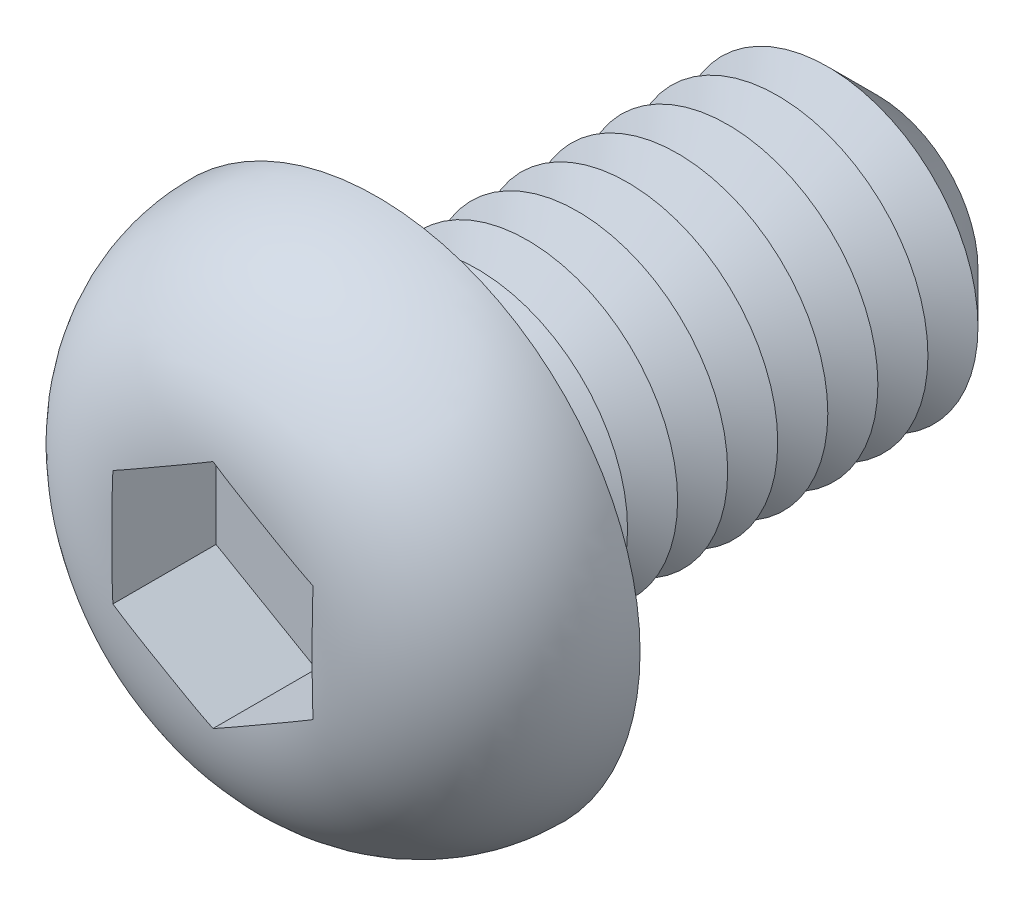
ISO-10303-21;
HEADER;
FILE_DESCRIPTION(('STEP AP214'),'2;1');
FILE_NAME('part.step','',(''),(''),'','','');
FILE_SCHEMA(('AUTOMOTIVE_DESIGN { 1 0 10303 214 1 1 1 1 }'));
ENDSEC;
DATA;
#1=APPLICATION_CONTEXT('core data for automotive mechanical design processes');
#2=APPLICATION_PROTOCOL_DEFINITION('international standard','automotive_design',2000,#1);
#3=PRODUCT_CONTEXT('',#1,'mechanical');
#4=PRODUCT('Part','Part','',(#3));
#5=PRODUCT_RELATED_PRODUCT_CATEGORY('part','',(#4));
#6=PRODUCT_DEFINITION_FORMATION('','',#4);
#7=PRODUCT_DEFINITION_CONTEXT('part definition',#1,'design');
#8=PRODUCT_DEFINITION('design','',#6,#7);
#9=PRODUCT_DEFINITION_SHAPE('','',#8);
#10=(LENGTH_UNIT() NAMED_UNIT(*) SI_UNIT(.MILLI.,.METRE.));
#11=(NAMED_UNIT(*) PLANE_ANGLE_UNIT() SI_UNIT($,.RADIAN.));
#12=(NAMED_UNIT(*) SI_UNIT($,.STERADIAN.) SOLID_ANGLE_UNIT());
#13=UNCERTAINTY_MEASURE_WITH_UNIT(LENGTH_MEASURE(1.E-05),#10,'distance_accuracy_value','');
#14=(GEOMETRIC_REPRESENTATION_CONTEXT(3) GLOBAL_UNCERTAINTY_ASSIGNED_CONTEXT((#13)) GLOBAL_UNIT_ASSIGNED_CONTEXT((#10,
#11,#12)) REPRESENTATION_CONTEXT('',''));
#15=CARTESIAN_POINT('',(0.,0.,0.));
#16=DIRECTION('',(0.,0.,1.));
#17=DIRECTION('',(1.,0.,0.));
#18=AXIS2_PLACEMENT_3D('',#15,#16,#17);
#19=CARTESIAN_POINT('',(0.,0.,-10.));
#20=DIRECTION('',(0.,0.,1.));
#21=DIRECTION('',(1.,0.,0.));
#22=AXIS2_PLACEMENT_3D('',#19,#20,#21);
#23=CYLINDRICAL_SURFACE('',#22,3.);
#24=CARTESIAN_POINT('',(0.,0.,-0.5));
#25=DIRECTION('',(0.,0.,1.));
#26=DIRECTION('',(1.,0.,0.));
#27=AXIS2_PLACEMENT_3D('',#24,#25,#26);
#28=CIRCLE('',#27,3.);
#29=CARTESIAN_POINT('',(3.,0.,-0.5));
#30=VERTEX_POINT('',#29);
#31=EDGE_CURVE('E48',#30,#30,#28,.F.);
#32=ORIENTED_EDGE('',*,*,#31,.T.);
#33=EDGE_LOOP('',(#32));
#34=FACE_BOUND('',#33,.T.);
#35=CARTESIAN_POINT('',(0.,0.,-1.));
#36=DIRECTION('',(0.,0.,1.));
#37=DIRECTION('',(1.,0.,0.));
#38=AXIS2_PLACEMENT_3D('',#35,#36,#37);
#39=CIRCLE('',#38,3.);
#40=CARTESIAN_POINT('',(3.,0.,-1.));
#41=VERTEX_POINT('',#40);
#42=EDGE_CURVE('E118',#41,#41,#39,.T.);
#43=ORIENTED_EDGE('',*,*,#42,.T.);
#44=EDGE_LOOP('',(#43));
#45=FACE_BOUND('',#44,.T.);
#46=ADVANCED_FACE('F39',(#34,#45),#23,.T.);
#47=CARTESIAN_POINT('',(0.,5.25,0.));
#48=DIRECTION('',(0.,0.,1.));
#49=DIRECTION('',(1.,0.,0.));
#50=AXIS2_PLACEMENT_3D('',#47,#48,#49);
#51=PLANE('',#50);
#52=CARTESIAN_POINT('',(0.,0.,0.));
#53=DIRECTION('',(0.,0.,1.));
#54=DIRECTION('',(1.,0.,0.));
#55=AXIS2_PLACEMENT_3D('',#52,#53,#54);
#56=CIRCLE('',#55,3.5);
#57=CARTESIAN_POINT('',(3.5,0.,0.));
#58=VERTEX_POINT('',#57);
#59=EDGE_CURVE('E11',#58,#58,#56,.T.);
#60=ORIENTED_EDGE('',*,*,#59,.T.);
#61=EDGE_LOOP('',(#60));
#62=FACE_BOUND('',#61,.T.);
#63=CARTESIAN_POINT('',(0.,0.,0.));
#64=DIRECTION('',(0.,0.,1.));
#65=DIRECTION('',(1.,0.,0.));
#66=AXIS2_PLACEMENT_3D('',#63,#64,#65);
#67=CIRCLE('',#66,5.25);
#68=CARTESIAN_POINT('',(5.25,0.,0.));
#69=VERTEX_POINT('',#68);
#70=EDGE_CURVE('E141',#69,#69,#67,.T.);
#71=ORIENTED_EDGE('',*,*,#70,.F.);
#72=EDGE_LOOP('',(#71));
#73=FACE_BOUND('',#72,.T.);
#74=ADVANCED_FACE('F216',(#62,#73),#51,.F.);
#75=CARTESIAN_POINT('',(0.,0.,0.));
#76=DIRECTION('',(0.,0.,1.));
#77=DIRECTION('',(1.,0.,0.));
#78=AXIS2_PLACEMENT_3D('',#75,#76,#77);
#79=DEGENERATE_TOROIDAL_SURFACE('',#78,1.95,3.3,.T.);
#80=CARTESIAN_POINT('',(-2.0002,1.15458506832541,3.28035788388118));
#81=CARTESIAN_POINT('',(-1.91691288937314,1.20267090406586,3.28561413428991));
#82=CARTESIAN_POINT('',(-1.83357497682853,1.25078607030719,3.2893341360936));
#83=CARTESIAN_POINT('',(-1.66686712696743,1.34703489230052,3.29467873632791));
#84=CARTESIAN_POINT('',(-1.58349720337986,1.39516854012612,3.29630387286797));
#85=CARTESIAN_POINT('',(-1.4167768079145,1.49142460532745,3.29843721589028));
#86=CARTESIAN_POINT('',(-1.33342633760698,1.53954702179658,3.29894575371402));
#87=CARTESIAN_POINT('',(-1.16671724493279,1.63579656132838,3.29953775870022));
#88=CARTESIAN_POINT('',(-1.0833586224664,1.68392368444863,3.29962119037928));
#89=CARTESIAN_POINT('',(-0.916641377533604,1.78017793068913,3.29962119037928));
#90=CARTESIAN_POINT('',(-0.833282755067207,1.82830505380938,3.29953775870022));
#91=CARTESIAN_POINT('',(-0.666573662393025,1.92455459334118,3.29894575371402));
#92=CARTESIAN_POINT('',(-0.5832231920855,1.97267700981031,3.29843721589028));
#93=CARTESIAN_POINT('',(-0.416502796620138,2.06893307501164,3.29630387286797));
#94=CARTESIAN_POINT('',(-0.333132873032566,2.11706672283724,3.29467873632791));
#95=CARTESIAN_POINT('',(-0.166425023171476,2.21331554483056,3.2893341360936));
#96=CARTESIAN_POINT('',(-0.083087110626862,2.2614307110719,3.28561413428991));
#97=CARTESIAN_POINT('',(0.000200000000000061,2.30951654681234,3.28035788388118));
#98=B_SPLINE_CURVE_WITH_KNOTS('',3,(#80,#81,#82,#83,#84,#85,#86,#87,#88,#89,#90,#91,#92,#93,#94,
#95,#96,#97),.UNSPECIFIED.,.F.,.F.,(4,2,2,2,2,2,2,2,4),(0.,0.288898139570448,0.577722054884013,
0.866460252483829,1.15522255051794,1.44398484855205,1.73272304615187,2.02154696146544,
2.31044510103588),.UNSPECIFIED.);
#99=CARTESIAN_POINT('',(-2.,1.15470053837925,3.28037053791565));
#100=VERTEX_POINT('',#99);
#101=CARTESIAN_POINT('',(0.,2.3094010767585,3.28037053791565));
#102=VERTEX_POINT('',#101);
#103=EDGE_CURVE('E157',#100,#102,#98,.T.);
#104=ORIENTED_EDGE('',*,*,#103,.T.);
#105=CARTESIAN_POINT('',(-0.000199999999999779,2.30951654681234,3.28035788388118));
#106=CARTESIAN_POINT('',(0.0830871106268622,2.2614307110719,3.28561413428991));
#107=CARTESIAN_POINT('',(0.166425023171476,2.21331554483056,3.2893341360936));
#108=CARTESIAN_POINT('',(0.333132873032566,2.11706672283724,3.29467873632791));
#109=CARTESIAN_POINT('',(0.416502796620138,2.06893307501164,3.29630387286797));
#110=CARTESIAN_POINT('',(0.5832231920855,1.97267700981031,3.29843721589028));
#111=CARTESIAN_POINT('',(0.666573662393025,1.92455459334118,3.29894575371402));
#112=CARTESIAN_POINT('',(0.833282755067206,1.82830505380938,3.29953775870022));
#113=CARTESIAN_POINT('',(0.916641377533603,1.78017793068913,3.29962119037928));
#114=CARTESIAN_POINT('',(1.0833586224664,1.68392368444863,3.29962119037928));
#115=CARTESIAN_POINT('',(1.16671724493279,1.63579656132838,3.29953775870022));
#116=CARTESIAN_POINT('',(1.33342633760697,1.53954702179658,3.29894575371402));
#117=CARTESIAN_POINT('',(1.4167768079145,1.49142460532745,3.29843721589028));
#118=CARTESIAN_POINT('',(1.58349720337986,1.39516854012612,3.29630387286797));
#119=CARTESIAN_POINT('',(1.66686712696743,1.34703489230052,3.29467873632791));
#120=CARTESIAN_POINT('',(1.83357497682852,1.25078607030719,3.2893341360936));
#121=CARTESIAN_POINT('',(1.91691288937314,1.20267090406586,3.28561413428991));
#122=CARTESIAN_POINT('',(2.0002,1.15458506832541,3.28035788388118));
#123=B_SPLINE_CURVE_WITH_KNOTS('',3,(#105,#106,#107,#108,#109,#110,#111,#112,#113,#114,#115,
#116,#117,#118,#119,#120,#121,#122),.UNSPECIFIED.,.F.,.F.,(4,2,2,2,2,2,2,2,4),(0.,
0.288898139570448,0.577722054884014,0.866460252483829,1.15522255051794,1.44398484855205,
1.73272304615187,2.02154696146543,2.31044510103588),.UNSPECIFIED.);
#124=CARTESIAN_POINT('',(2.,1.15470053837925,3.28037053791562));
#125=VERTEX_POINT('',#124);
#126=EDGE_CURVE('E98',#102,#125,#123,.T.);
#127=ORIENTED_EDGE('',*,*,#126,.T.);
#128=CARTESIAN_POINT('',(2.,0.,3.29962119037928));
#129=CARTESIAN_POINT('',(2.,-0.083776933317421,3.29962202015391));
#130=CARTESIAN_POINT('',(2.,-0.16755385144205,3.29955399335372));
#131=CARTESIAN_POINT('',(2.,-0.335108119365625,3.29913665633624));
#132=CARTESIAN_POINT('',(2.,-0.418885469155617,3.29878734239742));
#133=CARTESIAN_POINT('',(2.,-0.58647412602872,3.29739645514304));
#134=CARTESIAN_POINT('',(2.,-0.670285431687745,3.29635457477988));
#135=CARTESIAN_POINT('',(2.,-0.83788107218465,3.29299045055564));
#136=CARTESIAN_POINT('',(2.,-0.921665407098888,3.29066821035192));
#137=CARTESIAN_POINT('',(2.,-1.1722454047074,3.2807858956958));
#138=CARTESIAN_POINT('',(2.,-1.33895832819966,3.27031526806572));
#139=CARTESIAN_POINT('',(2.,-1.67103623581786,3.23635494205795));
#140=CARTESIAN_POINT('',(2.,-1.83640244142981,3.21287879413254));
#141=CARTESIAN_POINT('',(2.,-2.10344176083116,3.16074182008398));
#142=CARTESIAN_POINT('',(2.,-2.2061099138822,3.13718731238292));
#143=CARTESIAN_POINT('',(2.,-2.40948794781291,3.08263206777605));
#144=CARTESIAN_POINT('',(2.,-2.51019754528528,3.05163026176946));
#145=CARTESIAN_POINT('',(2.,-2.70894468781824,2.98167613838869));
#146=CARTESIAN_POINT('',(2.,-2.80697949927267,2.94271600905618));
#147=CARTESIAN_POINT('',(2.,-2.9994014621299,2.85662314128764));
#148=CARTESIAN_POINT('',(2.,-3.09378880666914,2.80949083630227));
#149=CARTESIAN_POINT('',(2.,-3.27874879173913,2.70660110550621));
#150=CARTESIAN_POINT('',(2.,-3.36928473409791,2.6507774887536));
#151=CARTESIAN_POINT('',(2.,-3.54476824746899,2.53095107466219));
#152=CARTESIAN_POINT('',(2.,-3.6297163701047,2.46694908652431));
#153=CARTESIAN_POINT('',(2.,-3.79309021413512,2.33110056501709));
#154=CARTESIAN_POINT('',(2.,-3.87151694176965,2.25925524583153));
#155=CARTESIAN_POINT('',(2.,-4.02093628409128,2.10826339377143));
#156=CARTESIAN_POINT('',(2.,-4.09192987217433,2.02911781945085));
#157=CARTESIAN_POINT('',(2.,-4.27732278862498,1.8003635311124));
#158=CARTESIAN_POINT('',(2.,-4.38297261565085,1.64348590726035));
#159=CARTESIAN_POINT('',(2.,-4.564185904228,1.31336862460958));
#160=CARTESIAN_POINT('',(2.,-4.63976443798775,1.14013721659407));
#161=CARTESIAN_POINT('',(2.,-4.75417820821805,0.794488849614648));
#162=CARTESIAN_POINT('',(2.,-4.79509243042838,0.622758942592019));
#163=CARTESIAN_POINT('',(2.,-4.84679751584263,0.274828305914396));
#164=CARTESIAN_POINT('',(2.,-4.85759267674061,0.098628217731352));
#165=CARTESIAN_POINT('',(2.,-4.8487955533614,-0.249157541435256));
#166=CARTESIAN_POINT('',(2.,-4.82985906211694,-0.420760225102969));
#167=CARTESIAN_POINT('',(2.,-4.76345103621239,-0.758322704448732));
#168=CARTESIAN_POINT('',(2.,-4.71598351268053,-0.924283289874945));
#169=CARTESIAN_POINT('',(2.,-4.59404942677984,-1.24604183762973));
#170=CARTESIAN_POINT('',(2.,-4.51956988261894,-1.40183487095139));
#171=CARTESIAN_POINT('',(2.,-4.34600859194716,-1.6990817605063));
#172=CARTESIAN_POINT('',(2.,-4.24691988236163,-1.84053154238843));
#173=CARTESIAN_POINT('',(2.,-4.02493220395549,-2.10847549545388));
#174=CARTESIAN_POINT('',(2.,-3.90156532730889,-2.23458080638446));
#175=CARTESIAN_POINT('',(2.,-3.63636218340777,-2.46550695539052));
#176=CARTESIAN_POINT('',(2.,-3.49453117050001,-2.57033382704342));
#177=CARTESIAN_POINT('',(2.,-3.26713798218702,-2.7130834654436));
#178=CARTESIAN_POINT('',(2.,-3.18660091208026,-2.75923686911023));
#179=CARTESIAN_POINT('',(2.,-3.02216370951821,-2.84520816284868));
#180=CARTESIAN_POINT('',(2.,-2.93826250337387,-2.88502400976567));
#181=CARTESIAN_POINT('',(2.,-2.76779132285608,-2.95832456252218));
#182=CARTESIAN_POINT('',(2.,-2.68122238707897,-2.99181169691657));
#183=CARTESIAN_POINT('',(2.,-2.50604626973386,-3.05263810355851));
#184=CARTESIAN_POINT('',(2.,-2.41744088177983,-3.07998257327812));
#185=CARTESIAN_POINT('',(2.,-2.20396420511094,-3.13835394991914));
#186=CARTESIAN_POINT('',(2.,-2.07835656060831,-3.16669536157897));
#187=CARTESIAN_POINT('',(2.,-1.82529007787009,-3.2134938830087));
#188=CARTESIAN_POINT('',(2.,-1.69783012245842,-3.23194474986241));
#189=CARTESIAN_POINT('',(2.,-1.44149598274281,-3.26083645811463));
#190=CARTESIAN_POINT('',(2.,-1.31261808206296,-3.27124272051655));
#191=CARTESIAN_POINT('',(2.,-1.05456848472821,-3.28623769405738));
#192=CARTESIAN_POINT('',(2.,-0.925396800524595,-3.29082664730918));
#193=CARTESIAN_POINT('',(2.,-0.665550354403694,-3.29674923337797));
#194=CARTESIAN_POINT('',(2.,-0.53487497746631,-3.29804579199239));
#195=CARTESIAN_POINT('',(2.,-0.273526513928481,-3.29947536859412));
#196=CARTESIAN_POINT('',(2.,-0.142853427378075,-3.29960842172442));
#197=CARTESIAN_POINT('',(2.,0.118243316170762,-3.29963281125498));
#198=CARTESIAN_POINT('',(2.,0.248666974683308,-3.29952460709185));
#199=CARTESIAN_POINT('',(2.,0.509509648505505,-3.29825409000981));
#200=CARTESIAN_POINT('',(2.,0.639928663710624,-3.29709183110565));
#201=CARTESIAN_POINT('',(2.,0.831730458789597,-3.29304171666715));
#202=CARTESIAN_POINT('',(2.,0.89313616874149,-3.29139197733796));
#203=CARTESIAN_POINT('',(2.,1.01591282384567,-3.28711504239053));
#204=CARTESIAN_POINT('',(2.,1.07728376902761,-3.28448784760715));
#205=CARTESIAN_POINT('',(2.,1.26131335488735,-3.27473407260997));
#206=CARTESIAN_POINT('',(2.,1.38388698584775,-3.2657353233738));
#207=CARTESIAN_POINT('',(2.,1.62750125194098,-3.24079239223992));
#208=CARTESIAN_POINT('',(2.,1.74854662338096,-3.22489680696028));
#209=CARTESIAN_POINT('',(2.,1.98924449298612,-3.18452451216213));
#210=CARTESIAN_POINT('',(2.,2.10889688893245,-3.16004717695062));
#211=CARTESIAN_POINT('',(2.,2.34827145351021,-3.10067973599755));
#212=CARTESIAN_POINT('',(2.,2.46794336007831,-3.06558373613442));
#213=CARTESIAN_POINT('',(2.,2.70350765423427,-2.98433995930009));
#214=CARTESIAN_POINT('',(2.,2.8194000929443,-2.9381923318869));
#215=CARTESIAN_POINT('',(2.,3.0462872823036,-2.83430045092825));
#216=CARTESIAN_POINT('',(2.,3.157267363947,-2.77652399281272));
#217=CARTESIAN_POINT('',(2.,3.37244069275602,-2.64945989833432));
#218=CARTESIAN_POINT('',(2.,3.47663511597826,-2.58017426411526));
#219=CARTESIAN_POINT('',(2.,3.66184410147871,-2.44158969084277));
#220=CARTESIAN_POINT('',(2.,3.74400419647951,-2.37381785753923));
#221=CARTESIAN_POINT('',(2.,3.90136233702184,-2.23063102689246));
#222=CARTESIAN_POINT('',(2.,3.9765614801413,-2.1552172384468));
#223=CARTESIAN_POINT('',(2.,4.11902811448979,-1.99742327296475));
#224=CARTESIAN_POINT('',(2.,4.18630715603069,-1.91505354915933));
#225=CARTESIAN_POINT('',(2.,4.31224227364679,-1.74401295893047));
#226=CARTESIAN_POINT('',(2.,4.37089943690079,-1.65534288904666));
#227=CARTESIAN_POINT('',(2.,4.51742320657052,-1.40720395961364));
#228=CARTESIAN_POINT('',(2.,4.59632371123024,-1.24230503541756));
#229=CARTESIAN_POINT('',(2.,4.72377654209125,-0.901269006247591));
#230=CARTESIAN_POINT('',(2.,4.77233626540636,-0.725134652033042));
#231=CARTESIAN_POINT('',(2.,4.83594291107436,-0.375162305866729));
#232=CARTESIAN_POINT('',(2.,4.85240855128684,-0.201581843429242));
#233=CARTESIAN_POINT('',(2.,4.85558073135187,0.145835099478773));
#234=CARTESIAN_POINT('',(2.,4.8422910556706,0.319671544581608));
#235=CARTESIAN_POINT('',(2.,4.78674180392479,0.660539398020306));
#236=CARTESIAN_POINT('',(2.,4.74482430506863,0.827626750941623));
#237=CARTESIAN_POINT('',(2.,4.63375789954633,1.15246461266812));
#238=CARTESIAN_POINT('',(2.,4.56461058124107,1.31021566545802));
#239=CARTESIAN_POINT('',(2.,4.40063624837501,1.61344814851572));
#240=CARTESIAN_POINT('',(2.,4.30559842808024,1.75881539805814));
#241=CARTESIAN_POINT('',(2.,4.09315528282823,2.03216183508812));
#242=CARTESIAN_POINT('',(2.,3.97574503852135,2.16013718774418));
#243=CARTESIAN_POINT('',(2.,3.71810418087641,2.3997527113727));
#244=CARTESIAN_POINT('',(2.,3.57725563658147,2.51072635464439));
#245=CARTESIAN_POINT('',(2.,3.28005668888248,2.70933274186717));
#246=CARTESIAN_POINT('',(2.,3.12370896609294,2.79696951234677));
#247=CARTESIAN_POINT('',(2.,2.85462284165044,2.92305372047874));
#248=CARTESIAN_POINT('',(2.,2.74490899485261,2.96813077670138));
#249=CARTESIAN_POINT('',(2.,2.52184151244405,3.04824715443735));
#250=CARTESIAN_POINT('',(2.,2.40848685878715,3.08328364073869));
#251=CARTESIAN_POINT('',(2.,2.17918323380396,3.14397693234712));
#252=CARTESIAN_POINT('',(2.,2.06323128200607,3.16962230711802));
#253=CARTESIAN_POINT('',(2.,1.82982653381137,3.21251895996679));
#254=CARTESIAN_POINT('',(2.,1.71237385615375,3.229770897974));
#255=CARTESIAN_POINT('',(2.,1.46252543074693,3.2589582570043));
#256=CARTESIAN_POINT('',(2.,1.3300298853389,3.27000580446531));
#257=CARTESIAN_POINT('',(2.,1.0646774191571,3.28585371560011));
#258=CARTESIAN_POINT('',(2.,0.931820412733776,3.29065244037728));
#259=CARTESIAN_POINT('',(2.,0.665789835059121,3.29677132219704));
#260=CARTESIAN_POINT('',(2.,0.532616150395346,3.29808470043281));
#261=CARTESIAN_POINT('',(2.,0.332868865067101,3.29913679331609));
#262=CARTESIAN_POINT('',(2.,0.266295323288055,3.2993345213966));
#263=CARTESIAN_POINT('',(2.,0.133147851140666,3.29957639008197));
#264=CARTESIAN_POINT('',(2.,0.0665739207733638,3.29962053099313));
#265=CARTESIAN_POINT('',(2.,0.,3.29962119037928));
#266=B_SPLINE_CURVE_WITH_KNOTS('',3,(#128,#129,#130,#131,#132,#133,#134,#135,#136,#137,#138,
#139,#140,#141,#142,#143,#144,#145,#146,#147,#148,#149,#150,#151,#152,#153,#154,#155,#156,#157,
#158,#159,#160,#161,#162,#163,#164,#165,#166,#167,#168,#169,#170,#171,#172,#173,#174,#175,#176,
#177,#178,#179,#180,#181,#182,#183,#184,#185,#186,#187,#188,#189,#190,#191,#192,#193,#194,#195,
#196,#197,#198,#199,#200,#201,#202,#203,#204,#205,#206,#207,#208,#209,#210,#211,#212,#213,#214,
#215,#216,#217,#218,#219,#220,#221,#222,#223,#224,#225,#226,#227,#228,#229,#230,#231,#232,#233,
#234,#235,#236,#237,#238,#239,#240,#241,#242,#243,#244,#245,#246,#247,#248,#249,#250,#251,#252,
#253,#254,#255,#256,#257,#258,#259,#260,#261,#262,#263,#264,#265),.UNSPECIFIED.,.T.,.F.,(4,2,2,
2,2,2,2,2,2,2,2,2,2,2,2,2,2,2,2,2,2,2,2,2,2,2,2,2,2,2,2,2,2,2,2,2,2,2,2,2,2,2,2,2,2,2,2,2,2,2,2,
2,2,2,2,2,2,2,2,2,2,2,2,2,2,2,2,2,4),(0.,0.251330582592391,0.502664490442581,0.754109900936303,
1.00555459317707,1.50637447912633,2.00667353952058,2.32243701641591,2.63824585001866,
2.95436618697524,3.27046976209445,3.58911045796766,3.90771965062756,4.22627959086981,
4.5447977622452,5.10896009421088,5.67283930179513,6.19985685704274,6.72679920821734,
7.24228104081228,7.75769041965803,8.27334782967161,8.78915130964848,9.3160918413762,
9.84288274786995,10.1211212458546,10.3994492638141,10.6776702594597,10.9556549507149,
11.3414617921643,11.727511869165,12.1152122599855,12.5028965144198,12.8949273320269,
13.2869463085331,13.6782193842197,14.0694724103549,14.2537488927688,14.4380252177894,
14.8065831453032,15.1725852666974,15.5386140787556,15.9122523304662,16.28588552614,
16.6605680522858,17.0351854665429,17.3542226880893,17.6732095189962,17.9917252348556,
18.3102007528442,18.8555909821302,19.4008481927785,19.9214008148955,20.4418872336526,
20.9562606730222,21.4706041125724,21.9892675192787,22.5080451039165,23.0436926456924,
23.5792477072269,23.9346277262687,24.2901079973,24.6460195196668,25.0019030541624,
25.4005476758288,25.7992968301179,26.1988209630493,26.3985429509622,26.5982645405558),.UNSPECIFIED.);
#267=CARTESIAN_POINT('',(2.,-1.15470053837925,3.28037053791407));
#268=VERTEX_POINT('',#267);
#269=EDGE_CURVE('E63',#125,#268,#266,.T.);
#270=ORIENTED_EDGE('',*,*,#269,.T.);
#271=CARTESIAN_POINT('',(2.0002,-1.15458506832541,3.28035788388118));
#272=CARTESIAN_POINT('',(1.91691288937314,-1.20267090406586,3.28561413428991));
#273=CARTESIAN_POINT('',(1.83357497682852,-1.25078607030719,3.2893341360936));
#274=CARTESIAN_POINT('',(1.66686712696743,-1.34703489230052,3.29467873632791));
#275=CARTESIAN_POINT('',(1.58349720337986,-1.39516854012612,3.29630387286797));
#276=CARTESIAN_POINT('',(1.4167768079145,-1.49142460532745,3.29843721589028));
#277=CARTESIAN_POINT('',(1.33342633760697,-1.53954702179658,3.29894575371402));
#278=CARTESIAN_POINT('',(1.16671724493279,-1.63579656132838,3.29953775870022));
#279=CARTESIAN_POINT('',(1.0833586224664,-1.68392368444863,3.29962119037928));
#280=CARTESIAN_POINT('',(0.916641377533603,-1.78017793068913,3.29962119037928));
#281=CARTESIAN_POINT('',(0.833282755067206,-1.82830505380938,3.29953775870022));
#282=CARTESIAN_POINT('',(0.666573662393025,-1.92455459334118,3.29894575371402));
#283=CARTESIAN_POINT('',(0.5832231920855,-1.97267700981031,3.29843721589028));
#284=CARTESIAN_POINT('',(0.416502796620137,-2.06893307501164,3.29630387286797));
#285=CARTESIAN_POINT('',(0.333132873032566,-2.11706672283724,3.29467873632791));
#286=CARTESIAN_POINT('',(0.166425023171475,-2.21331554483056,3.2893341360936));
#287=CARTESIAN_POINT('',(0.0830871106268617,-2.2614307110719,3.28561413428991));
#288=CARTESIAN_POINT('',(-0.000200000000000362,-2.30951654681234,3.28035788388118));
#289=B_SPLINE_CURVE_WITH_KNOTS('',3,(#271,#272,#273,#274,#275,#276,#277,#278,#279,#280,#281,
#282,#283,#284,#285,#286,#287,#288),.UNSPECIFIED.,.F.,.F.,(4,2,2,2,2,2,2,2,4),(0.,
0.288898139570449,0.577722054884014,0.86646025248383,1.15522255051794,1.44398484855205,
1.73272304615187,2.02154696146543,2.31044510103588),.UNSPECIFIED.);
#290=CARTESIAN_POINT('',(0.,-2.3094010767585,3.28037053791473));
#291=VERTEX_POINT('',#290);
#292=EDGE_CURVE('E237',#268,#291,#289,.T.);
#293=ORIENTED_EDGE('',*,*,#292,.T.);
#294=CARTESIAN_POINT('',(0.000199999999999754,-2.30951654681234,3.28035788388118));
#295=CARTESIAN_POINT('',(-0.0830871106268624,-2.2614307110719,3.28561413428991));
#296=CARTESIAN_POINT('',(-0.166425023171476,-2.21331554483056,3.2893341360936));
#297=CARTESIAN_POINT('',(-0.333132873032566,-2.11706672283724,3.29467873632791));
#298=CARTESIAN_POINT('',(-0.416502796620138,-2.06893307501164,3.29630387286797));
#299=CARTESIAN_POINT('',(-0.5832231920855,-1.97267700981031,3.29843721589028));
#300=CARTESIAN_POINT('',(-0.666573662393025,-1.92455459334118,3.29894575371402));
#301=CARTESIAN_POINT('',(-0.833282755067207,-1.82830505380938,3.29953775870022));
#302=CARTESIAN_POINT('',(-0.916641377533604,-1.78017793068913,3.29962119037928));
#303=CARTESIAN_POINT('',(-1.0833586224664,-1.68392368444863,3.29962119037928));
#304=CARTESIAN_POINT('',(-1.16671724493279,-1.63579656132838,3.29953775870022));
#305=CARTESIAN_POINT('',(-1.33342633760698,-1.53954702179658,3.29894575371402));
#306=CARTESIAN_POINT('',(-1.4167768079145,-1.49142460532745,3.29843721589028));
#307=CARTESIAN_POINT('',(-1.58349720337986,-1.39516854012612,3.29630387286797));
#308=CARTESIAN_POINT('',(-1.66686712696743,-1.34703489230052,3.29467873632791));
#309=CARTESIAN_POINT('',(-1.83357497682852,-1.25078607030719,3.2893341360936));
#310=CARTESIAN_POINT('',(-1.91691288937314,-1.20267090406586,3.28561413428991));
#311=CARTESIAN_POINT('',(-2.0002,-1.15458506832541,3.28035788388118));
#312=B_SPLINE_CURVE_WITH_KNOTS('',3,(#294,#295,#296,#297,#298,#299,#300,#301,#302,#303,#304,
#305,#306,#307,#308,#309,#310,#311),.UNSPECIFIED.,.F.,.F.,(4,2,2,2,2,2,2,2,4),(0.,
0.288898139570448,0.577722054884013,0.866460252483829,1.15522255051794,1.44398484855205,
1.73272304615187,2.02154696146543,2.31044510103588),.UNSPECIFIED.);
#313=CARTESIAN_POINT('',(-2.,-1.15470053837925,3.28037053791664));
#314=VERTEX_POINT('',#313);
#315=EDGE_CURVE('E243',#291,#314,#312,.T.);
#316=ORIENTED_EDGE('',*,*,#315,.T.);
#317=CARTESIAN_POINT('',(-2.,0.,3.29962119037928));
#318=CARTESIAN_POINT('',(-2.,0.083776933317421,3.29962202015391));
#319=CARTESIAN_POINT('',(-2.,0.16755385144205,3.29955399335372));
#320=CARTESIAN_POINT('',(-2.,0.335108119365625,3.29913665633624));
#321=CARTESIAN_POINT('',(-2.,0.418885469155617,3.29878734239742));
#322=CARTESIAN_POINT('',(-2.,0.58647412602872,3.29739645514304));
#323=CARTESIAN_POINT('',(-2.,0.670285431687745,3.29635457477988));
#324=CARTESIAN_POINT('',(-2.,0.83788107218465,3.29299045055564));
#325=CARTESIAN_POINT('',(-2.,0.921665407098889,3.29066821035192));
#326=CARTESIAN_POINT('',(-2.,1.1722454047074,3.2807858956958));
#327=CARTESIAN_POINT('',(-2.,1.33895832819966,3.27031526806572));
#328=CARTESIAN_POINT('',(-2.,1.67103623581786,3.23635494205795));
#329=CARTESIAN_POINT('',(-2.,1.83640244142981,3.21287879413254));
#330=CARTESIAN_POINT('',(-2.,2.10344176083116,3.16074182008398));
#331=CARTESIAN_POINT('',(-2.,2.2061099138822,3.13718731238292));
#332=CARTESIAN_POINT('',(-2.,2.40948794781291,3.08263206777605));
#333=CARTESIAN_POINT('',(-2.,2.51019754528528,3.05163026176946));
#334=CARTESIAN_POINT('',(-2.,2.70894468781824,2.98167613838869));
#335=CARTESIAN_POINT('',(-2.,2.80697949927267,2.94271600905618));
#336=CARTESIAN_POINT('',(-2.,2.9994014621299,2.85662314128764));
#337=CARTESIAN_POINT('',(-2.,3.09378880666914,2.80949083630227));
#338=CARTESIAN_POINT('',(-2.,3.27874879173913,2.70660110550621));
#339=CARTESIAN_POINT('',(-2.,3.36928473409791,2.6507774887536));
#340=CARTESIAN_POINT('',(-2.,3.54476824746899,2.53095107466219));
#341=CARTESIAN_POINT('',(-2.,3.6297163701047,2.46694908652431));
#342=CARTESIAN_POINT('',(-2.,3.79309021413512,2.33110056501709));
#343=CARTESIAN_POINT('',(-2.,3.87151694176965,2.25925524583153));
#344=CARTESIAN_POINT('',(-2.,4.02093628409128,2.10826339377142));
#345=CARTESIAN_POINT('',(-2.,4.09192987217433,2.02911781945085));
#346=CARTESIAN_POINT('',(-2.,4.27732278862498,1.8003635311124));
#347=CARTESIAN_POINT('',(-2.,4.38297261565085,1.64348590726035));
#348=CARTESIAN_POINT('',(-2.,4.564185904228,1.31336862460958));
#349=CARTESIAN_POINT('',(-2.,4.63976443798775,1.14013721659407));
#350=CARTESIAN_POINT('',(-2.,4.75417820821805,0.794488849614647));
#351=CARTESIAN_POINT('',(-2.,4.79509243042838,0.622758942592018));
#352=CARTESIAN_POINT('',(-2.,4.84679751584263,0.274828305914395));
#353=CARTESIAN_POINT('',(-2.,4.85759267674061,0.0986282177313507));
#354=CARTESIAN_POINT('',(-2.,4.8487955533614,-0.249157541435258));
#355=CARTESIAN_POINT('',(-2.,4.82985906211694,-0.42076022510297));
#356=CARTESIAN_POINT('',(-2.,4.76345103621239,-0.758322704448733));
#357=CARTESIAN_POINT('',(-2.,4.71598351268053,-0.924283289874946));
#358=CARTESIAN_POINT('',(-2.,4.59404942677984,-1.24604183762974));
#359=CARTESIAN_POINT('',(-2.,4.51956988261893,-1.40183487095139));
#360=CARTESIAN_POINT('',(-2.,4.34600859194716,-1.6990817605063));
#361=CARTESIAN_POINT('',(-2.,4.24691988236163,-1.84053154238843));
#362=CARTESIAN_POINT('',(-2.,4.02493220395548,-2.10847549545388));
#363=CARTESIAN_POINT('',(-2.,3.90156532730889,-2.23458080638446));
#364=CARTESIAN_POINT('',(-2.,3.63636218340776,-2.46550695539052));
#365=CARTESIAN_POINT('',(-2.,3.49453117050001,-2.57033382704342));
#366=CARTESIAN_POINT('',(-2.,3.26713798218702,-2.7130834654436));
#367=CARTESIAN_POINT('',(-2.,3.18660091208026,-2.75923686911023));
#368=CARTESIAN_POINT('',(-2.,3.02216370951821,-2.84520816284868));
#369=CARTESIAN_POINT('',(-2.,2.93826250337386,-2.88502400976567));
#370=CARTESIAN_POINT('',(-2.,2.76779132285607,-2.95832456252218));
#371=CARTESIAN_POINT('',(-2.,2.68122238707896,-2.99181169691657));
#372=CARTESIAN_POINT('',(-2.,2.50604626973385,-3.05263810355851));
#373=CARTESIAN_POINT('',(-2.,2.41744088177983,-3.07998257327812));
#374=CARTESIAN_POINT('',(-2.,2.20396420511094,-3.13835394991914));
#375=CARTESIAN_POINT('',(-2.,2.0783565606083,-3.16669536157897));
#376=CARTESIAN_POINT('',(-2.,1.82529007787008,-3.2134938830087));
#377=CARTESIAN_POINT('',(-2.,1.69783012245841,-3.23194474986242));
#378=CARTESIAN_POINT('',(-2.,1.4414959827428,-3.26083645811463));
#379=CARTESIAN_POINT('',(-2.,1.31261808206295,-3.27124272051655));
#380=CARTESIAN_POINT('',(-2.,1.0545684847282,-3.28623769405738));
#381=CARTESIAN_POINT('',(-2.,0.925396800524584,-3.29082664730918));
#382=CARTESIAN_POINT('',(-2.,0.665550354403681,-3.29674923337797));
#383=CARTESIAN_POINT('',(-2.,0.534874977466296,-3.29804579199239));
#384=CARTESIAN_POINT('',(-2.,0.273526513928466,-3.29947536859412));
#385=CARTESIAN_POINT('',(-2.,0.142853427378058,-3.29960842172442));
#386=CARTESIAN_POINT('',(-2.,-0.11824331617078,-3.29963281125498));
#387=CARTESIAN_POINT('',(-2.,-0.248666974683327,-3.29952460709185));
#388=CARTESIAN_POINT('',(-2.,-0.509509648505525,-3.29825409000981));
#389=CARTESIAN_POINT('',(-2.,-0.639928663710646,-3.29709183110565));
#390=CARTESIAN_POINT('',(-2.,-0.83173045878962,-3.29304171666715));
#391=CARTESIAN_POINT('',(-2.,-0.893136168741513,-3.29139197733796));
#392=CARTESIAN_POINT('',(-2.,-1.0159128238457,-3.28711504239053));
#393=CARTESIAN_POINT('',(-2.,-1.07728376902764,-3.28448784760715));
#394=CARTESIAN_POINT('',(-2.,-1.26131335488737,-3.27473407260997));
#395=CARTESIAN_POINT('',(-2.,-1.38388698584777,-3.2657353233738));
#396=CARTESIAN_POINT('',(-2.,-1.627501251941,-3.24079239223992));
#397=CARTESIAN_POINT('',(-2.,-1.74854662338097,-3.22489680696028));
#398=CARTESIAN_POINT('',(-2.,-1.98924449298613,-3.18452451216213));
#399=CARTESIAN_POINT('',(-2.,-2.10889688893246,-3.16004717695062));
#400=CARTESIAN_POINT('',(-2.,-2.34827145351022,-3.10067973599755));
#401=CARTESIAN_POINT('',(-2.,-2.46794336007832,-3.06558373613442));
#402=CARTESIAN_POINT('',(-2.,-2.70350765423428,-2.98433995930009));
#403=CARTESIAN_POINT('',(-2.,-2.81940009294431,-2.93819233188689));
#404=CARTESIAN_POINT('',(-2.,-3.0462872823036,-2.83430045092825));
#405=CARTESIAN_POINT('',(-2.,-3.157267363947,-2.77652399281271));
#406=CARTESIAN_POINT('',(-2.,-3.37244069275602,-2.64945989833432));
#407=CARTESIAN_POINT('',(-2.,-3.47663511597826,-2.58017426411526));
#408=CARTESIAN_POINT('',(-2.,-3.66184410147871,-2.44158969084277));
#409=CARTESIAN_POINT('',(-2.,-3.74400419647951,-2.37381785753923));
#410=CARTESIAN_POINT('',(-2.,-3.90136233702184,-2.23063102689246));
#411=CARTESIAN_POINT('',(-2.,-3.9765614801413,-2.1552172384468));
#412=CARTESIAN_POINT('',(-2.,-4.11902811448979,-1.99742327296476));
#413=CARTESIAN_POINT('',(-2.,-4.18630715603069,-1.91505354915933));
#414=CARTESIAN_POINT('',(-2.,-4.31224227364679,-1.74401295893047));
#415=CARTESIAN_POINT('',(-2.,-4.37089943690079,-1.65534288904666));
#416=CARTESIAN_POINT('',(-2.,-4.51742320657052,-1.40720395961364));
#417=CARTESIAN_POINT('',(-2.,-4.59632371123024,-1.24230503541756));
#418=CARTESIAN_POINT('',(-2.,-4.72377654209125,-0.901269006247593));
#419=CARTESIAN_POINT('',(-2.,-4.77233626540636,-0.725134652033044));
#420=CARTESIAN_POINT('',(-2.,-4.83594291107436,-0.37516230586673));
#421=CARTESIAN_POINT('',(-2.,-4.85240855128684,-0.201581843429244));
#422=CARTESIAN_POINT('',(-2.,-4.85558073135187,0.145835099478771));
#423=CARTESIAN_POINT('',(-2.,-4.8422910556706,0.319671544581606));
#424=CARTESIAN_POINT('',(-2.,-4.78674180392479,0.660539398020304));
#425=CARTESIAN_POINT('',(-2.,-4.74482430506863,0.827626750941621));
#426=CARTESIAN_POINT('',(-2.,-4.63375789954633,1.15246461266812));
#427=CARTESIAN_POINT('',(-2.,-4.56461058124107,1.31021566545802));
#428=CARTESIAN_POINT('',(-2.,-4.40063624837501,1.61344814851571));
#429=CARTESIAN_POINT('',(-2.,-4.30559842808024,1.75881539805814));
#430=CARTESIAN_POINT('',(-2.,-4.09315528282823,2.03216183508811));
#431=CARTESIAN_POINT('',(-2.,-3.97574503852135,2.16013718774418));
#432=CARTESIAN_POINT('',(-2.,-3.71810418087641,2.39975271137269));
#433=CARTESIAN_POINT('',(-2.,-3.57725563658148,2.51072635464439));
#434=CARTESIAN_POINT('',(-2.,-3.28005668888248,2.70933274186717));
#435=CARTESIAN_POINT('',(-2.,-3.12370896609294,2.79696951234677));
#436=CARTESIAN_POINT('',(-2.,-2.85462284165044,2.92305372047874));
#437=CARTESIAN_POINT('',(-2.,-2.74490899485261,2.96813077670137));
#438=CARTESIAN_POINT('',(-2.,-2.52184151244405,3.04824715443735));
#439=CARTESIAN_POINT('',(-2.,-2.40848685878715,3.08328364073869));
#440=CARTESIAN_POINT('',(-2.,-2.17918323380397,3.14397693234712));
#441=CARTESIAN_POINT('',(-2.,-2.06323128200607,3.16962230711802));
#442=CARTESIAN_POINT('',(-2.,-1.82982653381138,3.21251895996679));
#443=CARTESIAN_POINT('',(-2.,-1.71237385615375,3.229770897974));
#444=CARTESIAN_POINT('',(-2.,-1.46252543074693,3.2589582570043));
#445=CARTESIAN_POINT('',(-2.,-1.33002988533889,3.27000580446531));
#446=CARTESIAN_POINT('',(-2.,-1.0646774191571,3.28585371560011));
#447=CARTESIAN_POINT('',(-2.,-0.931820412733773,3.29065244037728));
#448=CARTESIAN_POINT('',(-2.,-0.66578983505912,3.29677132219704));
#449=CARTESIAN_POINT('',(-2.,-0.532616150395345,3.29808470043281));
#450=CARTESIAN_POINT('',(-2.,-0.332868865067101,3.29913679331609));
#451=CARTESIAN_POINT('',(-2.,-0.266295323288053,3.2993345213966));
#452=CARTESIAN_POINT('',(-2.,-0.133147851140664,3.29957639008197));
#453=CARTESIAN_POINT('',(-2.,-0.0665739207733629,3.29962053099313));
#454=CARTESIAN_POINT('',(-2.,0.,3.29962119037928));
#455=B_SPLINE_CURVE_WITH_KNOTS('',3,(#317,#318,#319,#320,#321,#322,#323,#324,#325,#326,#327,
#328,#329,#330,#331,#332,#333,#334,#335,#336,#337,#338,#339,#340,#341,#342,#343,#344,#345,#346,
#347,#348,#349,#350,#351,#352,#353,#354,#355,#356,#357,#358,#359,#360,#361,#362,#363,#364,#365,
#366,#367,#368,#369,#370,#371,#372,#373,#374,#375,#376,#377,#378,#379,#380,#381,#382,#383,#384,
#385,#386,#387,#388,#389,#390,#391,#392,#393,#394,#395,#396,#397,#398,#399,#400,#401,#402,#403,
#404,#405,#406,#407,#408,#409,#410,#411,#412,#413,#414,#415,#416,#417,#418,#419,#420,#421,#422,
#423,#424,#425,#426,#427,#428,#429,#430,#431,#432,#433,#434,#435,#436,#437,#438,#439,#440,#441,
#442,#443,#444,#445,#446,#447,#448,#449,#450,#451,#452,#453,#454),.UNSPECIFIED.,.T.,.F.,(4,2,2,
2,2,2,2,2,2,2,2,2,2,2,2,2,2,2,2,2,2,2,2,2,2,2,2,2,2,2,2,2,2,2,2,2,2,2,2,2,2,2,2,2,2,2,2,2,2,2,2,
2,2,2,2,2,2,2,2,2,2,2,2,2,2,2,2,2,4),(0.,0.251330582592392,0.502664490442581,0.754109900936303,
1.00555459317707,1.50637447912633,2.00667353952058,2.32243701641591,2.63824585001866,
2.95436618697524,3.27046976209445,3.58911045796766,3.90771965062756,4.22627959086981,
4.5447977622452,5.10896009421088,5.67283930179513,6.19985685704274,6.72679920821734,
7.24228104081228,7.75769041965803,8.27334782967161,8.78915130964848,9.3160918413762,
9.84288274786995,10.1211212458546,10.3994492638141,10.6776702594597,10.9556549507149,
11.3414617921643,11.727511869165,12.1152122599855,12.5028965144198,12.8949273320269,
13.2869463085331,13.6782193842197,14.0694724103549,14.2537488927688,14.4380252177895,
14.8065831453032,15.1725852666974,15.5386140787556,15.9122523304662,16.28588552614,
16.6605680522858,17.0351854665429,17.3542226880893,17.6732095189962,17.9917252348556,
18.3102007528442,18.8555909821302,19.4008481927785,19.9214008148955,20.4418872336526,
20.9562606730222,21.4706041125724,21.9892675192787,22.5080451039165,23.0436926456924,
23.5792477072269,23.9346277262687,24.2901079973,24.6460195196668,25.0019030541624,
25.4005476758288,25.7992968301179,26.1988209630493,26.3985429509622,26.5982645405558),.UNSPECIFIED.);
#456=EDGE_CURVE('E165',#314,#100,#455,.T.);
#457=ORIENTED_EDGE('',*,*,#456,.T.);
#458=EDGE_LOOP('',(#104,#127,#270,#293,#316,#457));
#459=FACE_BOUND('',#458,.T.);
#460=ORIENTED_EDGE('',*,*,#70,.T.);
#461=EDGE_LOOP('',(#460));
#462=FACE_BOUND('',#461,.T.);
#463=ADVANCED_FACE('F170',(#459,#462),#79,.T.);
#464=CARTESIAN_POINT('',(2.,1.15470053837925,1.22));
#465=DIRECTION('',(0.5,0.866025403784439,0.));
#466=DIRECTION('',(-0.866025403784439,0.5,0.));
#467=AXIS2_PLACEMENT_3D('',#464,#465,#466);
#468=PLANE('',#467);
#469=DIRECTION('',(0.,0.,1.));
#470=VECTOR('',#469,1.);
#471=CARTESIAN_POINT('',(0.,2.3094010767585,1.22));
#472=LINE('',#471,#470);
#473=CARTESIAN_POINT('',(0.,2.3094010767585,1.22));
#474=VERTEX_POINT('',#473);
#475=EDGE_CURVE('E55',#474,#102,#472,.T.);
#476=ORIENTED_EDGE('',*,*,#475,.F.);
#477=DIRECTION('',(-0.866025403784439,0.5,0.));
#478=VECTOR('',#477,1.);
#479=CARTESIAN_POINT('',(2.,1.15470053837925,1.22));
#480=LINE('',#479,#478);
#481=CARTESIAN_POINT('',(2.,1.15470053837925,1.22));
#482=VERTEX_POINT('',#481);
#483=EDGE_CURVE('E95',#482,#474,#480,.T.);
#484=ORIENTED_EDGE('',*,*,#483,.F.);
#485=DIRECTION('',(0.,0.,1.));
#486=VECTOR('',#485,1.);
#487=CARTESIAN_POINT('',(2.,1.15470053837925,1.22));
#488=LINE('',#487,#486);
#489=EDGE_CURVE('E138',#482,#125,#488,.T.);
#490=ORIENTED_EDGE('',*,*,#489,.T.);
#491=ORIENTED_EDGE('',*,*,#126,.F.);
#492=EDGE_LOOP('',(#476,#484,#490,#491));
#493=FACE_BOUND('',#492,.T.);
#494=ADVANCED_FACE('F93',(#493),#468,.F.);
#495=CARTESIAN_POINT('',(2.,-1.15470053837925,1.22));
#496=DIRECTION('',(1.,0.,0.));
#497=DIRECTION('',(0.,1.,0.));
#498=AXIS2_PLACEMENT_3D('',#495,#496,#497);
#499=PLANE('',#498);
#500=ORIENTED_EDGE('',*,*,#489,.F.);
#501=DIRECTION('',(0.,1.,0.));
#502=VECTOR('',#501,1.);
#503=CARTESIAN_POINT('',(2.,-1.15470053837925,1.22));
#504=LINE('',#503,#502);
#505=CARTESIAN_POINT('',(2.,-1.15470053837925,1.22));
#506=VERTEX_POINT('',#505);
#507=EDGE_CURVE('E102',#506,#482,#504,.T.);
#508=ORIENTED_EDGE('',*,*,#507,.F.);
#509=DIRECTION('',(0.,0.,1.));
#510=VECTOR('',#509,1.);
#511=CARTESIAN_POINT('',(2.,-1.15470053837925,1.22));
#512=LINE('',#511,#510);
#513=EDGE_CURVE('E142',#506,#268,#512,.T.);
#514=ORIENTED_EDGE('',*,*,#513,.T.);
#515=ORIENTED_EDGE('',*,*,#269,.F.);
#516=EDGE_LOOP('',(#500,#508,#514,#515));
#517=FACE_BOUND('',#516,.T.);
#518=ADVANCED_FACE('F181',(#517),#499,.F.);
#519=CARTESIAN_POINT('',(0.,-2.3094010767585,1.22));
#520=DIRECTION('',(0.5,-0.866025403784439,0.));
#521=DIRECTION('',(0.866025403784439,0.5,0.));
#522=AXIS2_PLACEMENT_3D('',#519,#520,#521);
#523=PLANE('',#522);
#524=ORIENTED_EDGE('',*,*,#513,.F.);
#525=DIRECTION('',(0.866025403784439,0.5,0.));
#526=VECTOR('',#525,1.);
#527=CARTESIAN_POINT('',(0.,-2.3094010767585,1.22));
#528=LINE('',#527,#526);
#529=CARTESIAN_POINT('',(0.,-2.3094010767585,1.22));
#530=VERTEX_POINT('',#529);
#531=EDGE_CURVE('E133',#530,#506,#528,.T.);
#532=ORIENTED_EDGE('',*,*,#531,.F.);
#533=DIRECTION('',(0.,0.,1.));
#534=VECTOR('',#533,1.);
#535=CARTESIAN_POINT('',(0.,-2.3094010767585,1.22));
#536=LINE('',#535,#534);
#537=EDGE_CURVE('E145',#530,#291,#536,.T.);
#538=ORIENTED_EDGE('',*,*,#537,.T.);
#539=ORIENTED_EDGE('',*,*,#292,.F.);
#540=EDGE_LOOP('',(#524,#532,#538,#539));
#541=FACE_BOUND('',#540,.T.);
#542=ADVANCED_FACE('F231',(#541),#523,.F.);
#543=CARTESIAN_POINT('',(-2.,-1.15470053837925,1.22));
#544=DIRECTION('',(-0.5,-0.866025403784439,0.));
#545=DIRECTION('',(0.866025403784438,-0.5,0.));
#546=AXIS2_PLACEMENT_3D('',#543,#544,#545);
#547=PLANE('',#546);
#548=ORIENTED_EDGE('',*,*,#537,.F.);
#549=DIRECTION('',(0.866025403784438,-0.5,0.));
#550=VECTOR('',#549,1.);
#551=CARTESIAN_POINT('',(-2.,-1.15470053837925,1.22));
#552=LINE('',#551,#550);
#553=CARTESIAN_POINT('',(-2.,-1.15470053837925,1.22));
#554=VERTEX_POINT('',#553);
#555=EDGE_CURVE('E129',#554,#530,#552,.T.);
#556=ORIENTED_EDGE('',*,*,#555,.F.);
#557=DIRECTION('',(0.,0.,1.));
#558=VECTOR('',#557,1.);
#559=CARTESIAN_POINT('',(-2.,-1.15470053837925,1.22));
#560=LINE('',#559,#558);
#561=EDGE_CURVE('E149',#554,#314,#560,.T.);
#562=ORIENTED_EDGE('',*,*,#561,.T.);
#563=ORIENTED_EDGE('',*,*,#315,.F.);
#564=EDGE_LOOP('',(#548,#556,#562,#563));
#565=FACE_BOUND('',#564,.T.);
#566=ADVANCED_FACE('F234',(#565),#547,.F.);
#567=CARTESIAN_POINT('',(-2.,1.15470053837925,1.22));
#568=DIRECTION('',(-1.,0.,0.));
#569=DIRECTION('',(0.,-1.,0.));
#570=AXIS2_PLACEMENT_3D('',#567,#568,#569);
#571=PLANE('',#570);
#572=ORIENTED_EDGE('',*,*,#561,.F.);
#573=DIRECTION('',(0.,-1.,0.));
#574=VECTOR('',#573,1.);
#575=CARTESIAN_POINT('',(-2.,1.15470053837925,1.22));
#576=LINE('',#575,#574);
#577=CARTESIAN_POINT('',(-2.,1.15470053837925,1.22));
#578=VERTEX_POINT('',#577);
#579=EDGE_CURVE('E112',#578,#554,#576,.T.);
#580=ORIENTED_EDGE('',*,*,#579,.F.);
#581=DIRECTION('',(0.,0.,1.));
#582=VECTOR('',#581,1.);
#583=CARTESIAN_POINT('',(-2.,1.15470053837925,1.22));
#584=LINE('',#583,#582);
#585=EDGE_CURVE('E101',#578,#100,#584,.T.);
#586=ORIENTED_EDGE('',*,*,#585,.T.);
#587=ORIENTED_EDGE('',*,*,#456,.F.);
#588=EDGE_LOOP('',(#572,#580,#586,#587));
#589=FACE_BOUND('',#588,.T.);
#590=ADVANCED_FACE('F176',(#589),#571,.F.);
#591=CARTESIAN_POINT('',(0.,2.3094010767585,1.22));
#592=DIRECTION('',(-0.5,0.866025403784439,0.));
#593=DIRECTION('',(-0.866025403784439,-0.5,0.));
#594=AXIS2_PLACEMENT_3D('',#591,#592,#593);
#595=PLANE('',#594);
#596=ORIENTED_EDGE('',*,*,#585,.F.);
#597=DIRECTION('',(-0.866025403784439,-0.5,0.));
#598=VECTOR('',#597,1.);
#599=CARTESIAN_POINT('',(0.,2.3094010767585,1.22));
#600=LINE('',#599,#598);
#601=EDGE_CURVE('E105',#474,#578,#600,.T.);
#602=ORIENTED_EDGE('',*,*,#601,.F.);
#603=ORIENTED_EDGE('',*,*,#475,.T.);
#604=ORIENTED_EDGE('',*,*,#103,.F.);
#605=EDGE_LOOP('',(#596,#602,#603,#604));
#606=FACE_BOUND('',#605,.T.);
#607=ADVANCED_FACE('F106',(#606),#595,.F.);
#608=CARTESIAN_POINT('',(0.,0.,1.22));
#609=DIRECTION('',(0.,0.,1.));
#610=DIRECTION('',(1.,0.,0.));
#611=AXIS2_PLACEMENT_3D('',#608,#609,#610);
#612=PLANE('',#611);
#613=CARTESIAN_POINT('',(0.,0.,1.22));
#614=DIRECTION('',(0.,0.,1.));
#615=DIRECTION('',(1.,0.,0.));
#616=AXIS2_PLACEMENT_3D('',#613,#614,#615);
#617=CIRCLE('',#616,0.8);
#618=CARTESIAN_POINT('',(0.8,0.,1.22));
#619=VERTEX_POINT('',#618);
#620=EDGE_CURVE('E327',#619,#619,#617,.T.);
#621=ORIENTED_EDGE('',*,*,#620,.F.);
#622=EDGE_LOOP('',(#621));
#623=FACE_BOUND('',#622,.T.);
#624=ORIENTED_EDGE('',*,*,#483,.T.);
#625=ORIENTED_EDGE('',*,*,#601,.T.);
#626=ORIENTED_EDGE('',*,*,#579,.T.);
#627=ORIENTED_EDGE('',*,*,#555,.T.);
#628=ORIENTED_EDGE('',*,*,#531,.T.);
#629=ORIENTED_EDGE('',*,*,#507,.T.);
#630=EDGE_LOOP('',(#624,#625,#626,#627,#628,#629));
#631=FACE_BOUND('',#630,.T.);
#632=ADVANCED_FACE('F114',(#623,#631),#612,.T.);
#633=CARTESIAN_POINT('',(0.,0.,-1.));
#634=DIRECTION('',(0.,0.,1.));
#635=DIRECTION('',(1.,0.,0.));
#636=AXIS2_PLACEMENT_3D('',#633,#634,#635);
#637=CONICAL_SURFACE('',#636,3.,1.0471975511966);
#638=CARTESIAN_POINT('',(0.,0.,-1.5));
#639=DIRECTION('',(0.,0.,1.));
#640=DIRECTION('',(1.,0.,0.));
#641=AXIS2_PLACEMENT_3D('',#638,#639,#640);
#642=CIRCLE('',#641,2.13397459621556);
#643=CARTESIAN_POINT('',(2.13397459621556,0.,-1.5));
#644=VERTEX_POINT('',#643);
#645=EDGE_CURVE('E123',#644,#644,#642,.T.);
#646=ORIENTED_EDGE('',*,*,#645,.T.);
#647=EDGE_LOOP('',(#646));
#648=FACE_BOUND('',#647,.T.);
#649=ORIENTED_EDGE('',*,*,#42,.F.);
#650=EDGE_LOOP('',(#649));
#651=FACE_BOUND('',#650,.T.);
#652=ADVANCED_FACE('F226',(#648,#651),#637,.T.);
#653=CARTESIAN_POINT('',(0.,0.,-1.5));
#654=DIRECTION('',(0.,0.,-1.));
#655=DIRECTION('',(-1.,0.,0.));
#656=AXIS2_PLACEMENT_3D('',#653,#654,#655);
#657=CONICAL_SURFACE('',#656,2.13397459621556,1.0471975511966);
#658=CARTESIAN_POINT('',(0.,0.,-2.));
#659=DIRECTION('',(0.,0.,1.));
#660=DIRECTION('',(1.,0.,0.));
#661=AXIS2_PLACEMENT_3D('',#658,#659,#660);
#662=CIRCLE('',#661,3.);
#663=CARTESIAN_POINT('',(3.,0.,-2.));
#664=VERTEX_POINT('',#663);
#665=EDGE_CURVE('E270',#664,#664,#662,.T.);
#666=ORIENTED_EDGE('',*,*,#665,.T.);
#667=EDGE_LOOP('',(#666));
#668=FACE_BOUND('',#667,.T.);
#669=ORIENTED_EDGE('',*,*,#645,.F.);
#670=EDGE_LOOP('',(#669));
#671=FACE_BOUND('',#670,.T.);
#672=ADVANCED_FACE('F399',(#668,#671),#657,.T.);
#673=CARTESIAN_POINT('',(0.,0.,-2.));
#674=DIRECTION('',(0.,0.,1.));
#675=DIRECTION('',(1.,0.,0.));
#676=AXIS2_PLACEMENT_3D('',#673,#674,#675);
#677=CONICAL_SURFACE('',#676,3.,1.0471975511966);
#678=CARTESIAN_POINT('',(0.,0.,-2.5));
#679=DIRECTION('',(0.,0.,1.));
#680=DIRECTION('',(1.,0.,0.));
#681=AXIS2_PLACEMENT_3D('',#678,#679,#680);
#682=CIRCLE('',#681,2.13397459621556);
#683=CARTESIAN_POINT('',(2.13397459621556,0.,-2.5));
#684=VERTEX_POINT('',#683);
#685=EDGE_CURVE('E275',#684,#684,#682,.T.);
#686=ORIENTED_EDGE('',*,*,#685,.T.);
#687=EDGE_LOOP('',(#686));
#688=FACE_BOUND('',#687,.T.);
#689=ORIENTED_EDGE('',*,*,#665,.F.);
#690=EDGE_LOOP('',(#689));
#691=FACE_BOUND('',#690,.T.);
#692=ADVANCED_FACE('F395',(#688,#691),#677,.T.);
#693=CARTESIAN_POINT('',(0.,0.,-2.5));
#694=DIRECTION('',(0.,0.,-1.));
#695=DIRECTION('',(-1.,0.,0.));
#696=AXIS2_PLACEMENT_3D('',#693,#694,#695);
#697=CONICAL_SURFACE('',#696,2.13397459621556,1.0471975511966);
#698=CARTESIAN_POINT('',(0.,0.,-3.));
#699=DIRECTION('',(0.,0.,1.));
#700=DIRECTION('',(1.,0.,0.));
#701=AXIS2_PLACEMENT_3D('',#698,#699,#700);
#702=CIRCLE('',#701,3.);
#703=CARTESIAN_POINT('',(3.,0.,-3.));
#704=VERTEX_POINT('',#703);
#705=EDGE_CURVE('E281',#704,#704,#702,.T.);
#706=ORIENTED_EDGE('',*,*,#705,.T.);
#707=EDGE_LOOP('',(#706));
#708=FACE_BOUND('',#707,.T.);
#709=ORIENTED_EDGE('',*,*,#685,.F.);
#710=EDGE_LOOP('',(#709));
#711=FACE_BOUND('',#710,.T.);
#712=ADVANCED_FACE('F391',(#708,#711),#697,.T.);
#713=CARTESIAN_POINT('',(0.,0.,-3.));
#714=DIRECTION('',(0.,0.,1.));
#715=DIRECTION('',(1.,0.,0.));
#716=AXIS2_PLACEMENT_3D('',#713,#714,#715);
#717=CONICAL_SURFACE('',#716,3.,1.0471975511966);
#718=CARTESIAN_POINT('',(0.,0.,-3.5));
#719=DIRECTION('',(0.,0.,1.));
#720=DIRECTION('',(1.,0.,0.));
#721=AXIS2_PLACEMENT_3D('',#718,#719,#720);
#722=CIRCLE('',#721,2.13397459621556);
#723=CARTESIAN_POINT('',(2.13397459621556,0.,-3.5));
#724=VERTEX_POINT('',#723);
#725=EDGE_CURVE('E285',#724,#724,#722,.T.);
#726=ORIENTED_EDGE('',*,*,#725,.T.);
#727=EDGE_LOOP('',(#726));
#728=FACE_BOUND('',#727,.T.);
#729=ORIENTED_EDGE('',*,*,#705,.F.);
#730=EDGE_LOOP('',(#729));
#731=FACE_BOUND('',#730,.T.);
#732=ADVANCED_FACE('F387',(#728,#731),#717,.T.);
#733=CARTESIAN_POINT('',(0.,0.,-3.5));
#734=DIRECTION('',(0.,0.,-1.));
#735=DIRECTION('',(-1.,0.,0.));
#736=AXIS2_PLACEMENT_3D('',#733,#734,#735);
#737=CONICAL_SURFACE('',#736,2.13397459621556,1.0471975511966);
#738=CARTESIAN_POINT('',(0.,0.,-4.));
#739=DIRECTION('',(0.,0.,1.));
#740=DIRECTION('',(1.,0.,0.));
#741=AXIS2_PLACEMENT_3D('',#738,#739,#740);
#742=CIRCLE('',#741,3.);
#743=CARTESIAN_POINT('',(3.,0.,-4.));
#744=VERTEX_POINT('',#743);
#745=EDGE_CURVE('E288',#744,#744,#742,.T.);
#746=ORIENTED_EDGE('',*,*,#745,.T.);
#747=EDGE_LOOP('',(#746));
#748=FACE_BOUND('',#747,.T.);
#749=ORIENTED_EDGE('',*,*,#725,.F.);
#750=EDGE_LOOP('',(#749));
#751=FACE_BOUND('',#750,.T.);
#752=ADVANCED_FACE('F383',(#748,#751),#737,.T.);
#753=CARTESIAN_POINT('',(0.,0.,-4.));
#754=DIRECTION('',(0.,0.,1.));
#755=DIRECTION('',(1.,0.,0.));
#756=AXIS2_PLACEMENT_3D('',#753,#754,#755);
#757=CONICAL_SURFACE('',#756,3.,1.0471975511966);
#758=CARTESIAN_POINT('',(0.,0.,-4.5));
#759=DIRECTION('',(0.,0.,1.));
#760=DIRECTION('',(1.,0.,0.));
#761=AXIS2_PLACEMENT_3D('',#758,#759,#760);
#762=CIRCLE('',#761,2.13397459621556);
#763=CARTESIAN_POINT('',(2.13397459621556,0.,-4.5));
#764=VERTEX_POINT('',#763);
#765=EDGE_CURVE('E292',#764,#764,#762,.T.);
#766=ORIENTED_EDGE('',*,*,#765,.T.);
#767=EDGE_LOOP('',(#766));
#768=FACE_BOUND('',#767,.T.);
#769=ORIENTED_EDGE('',*,*,#745,.F.);
#770=EDGE_LOOP('',(#769));
#771=FACE_BOUND('',#770,.T.);
#772=ADVANCED_FACE('F379',(#768,#771),#757,.T.);
#773=CARTESIAN_POINT('',(0.,0.,-4.5));
#774=DIRECTION('',(0.,0.,-1.));
#775=DIRECTION('',(-1.,0.,0.));
#776=AXIS2_PLACEMENT_3D('',#773,#774,#775);
#777=CONICAL_SURFACE('',#776,2.13397459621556,1.0471975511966);
#778=CARTESIAN_POINT('',(0.,0.,-5.));
#779=DIRECTION('',(0.,0.,1.));
#780=DIRECTION('',(1.,0.,0.));
#781=AXIS2_PLACEMENT_3D('',#778,#779,#780);
#782=CIRCLE('',#781,3.);
#783=CARTESIAN_POINT('',(3.,0.,-5.));
#784=VERTEX_POINT('',#783);
#785=EDGE_CURVE('E296',#784,#784,#782,.T.);
#786=ORIENTED_EDGE('',*,*,#785,.T.);
#787=EDGE_LOOP('',(#786));
#788=FACE_BOUND('',#787,.T.);
#789=ORIENTED_EDGE('',*,*,#765,.F.);
#790=EDGE_LOOP('',(#789));
#791=FACE_BOUND('',#790,.T.);
#792=ADVANCED_FACE('F375',(#788,#791),#777,.T.);
#793=CARTESIAN_POINT('',(0.,0.,-5.));
#794=DIRECTION('',(0.,0.,1.));
#795=DIRECTION('',(1.,0.,0.));
#796=AXIS2_PLACEMENT_3D('',#793,#794,#795);
#797=CONICAL_SURFACE('',#796,3.,1.0471975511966);
#798=CARTESIAN_POINT('',(0.,0.,-5.5));
#799=DIRECTION('',(0.,0.,1.));
#800=DIRECTION('',(1.,0.,0.));
#801=AXIS2_PLACEMENT_3D('',#798,#799,#800);
#802=CIRCLE('',#801,2.13397459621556);
#803=CARTESIAN_POINT('',(2.13397459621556,0.,-5.5));
#804=VERTEX_POINT('',#803);
#805=EDGE_CURVE('E300',#804,#804,#802,.T.);
#806=ORIENTED_EDGE('',*,*,#805,.T.);
#807=EDGE_LOOP('',(#806));
#808=FACE_BOUND('',#807,.T.);
#809=ORIENTED_EDGE('',*,*,#785,.F.);
#810=EDGE_LOOP('',(#809));
#811=FACE_BOUND('',#810,.T.);
#812=ADVANCED_FACE('F371',(#808,#811),#797,.T.);
#813=CARTESIAN_POINT('',(0.,0.,-5.5));
#814=DIRECTION('',(0.,0.,-1.));
#815=DIRECTION('',(-1.,0.,0.));
#816=AXIS2_PLACEMENT_3D('',#813,#814,#815);
#817=CONICAL_SURFACE('',#816,2.13397459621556,1.0471975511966);
#818=CARTESIAN_POINT('',(0.,0.,-6.));
#819=DIRECTION('',(0.,0.,1.));
#820=DIRECTION('',(1.,0.,0.));
#821=AXIS2_PLACEMENT_3D('',#818,#819,#820);
#822=CIRCLE('',#821,3.);
#823=CARTESIAN_POINT('',(3.,0.,-6.));
#824=VERTEX_POINT('',#823);
#825=EDGE_CURVE('E304',#824,#824,#822,.T.);
#826=ORIENTED_EDGE('',*,*,#825,.T.);
#827=EDGE_LOOP('',(#826));
#828=FACE_BOUND('',#827,.T.);
#829=ORIENTED_EDGE('',*,*,#805,.F.);
#830=EDGE_LOOP('',(#829));
#831=FACE_BOUND('',#830,.T.);
#832=ADVANCED_FACE('F367',(#828,#831),#817,.T.);
#833=CARTESIAN_POINT('',(0.,0.,-6.));
#834=DIRECTION('',(0.,0.,1.));
#835=DIRECTION('',(1.,0.,0.));
#836=AXIS2_PLACEMENT_3D('',#833,#834,#835);
#837=CONICAL_SURFACE('',#836,3.,1.0471975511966);
#838=CARTESIAN_POINT('',(0.,0.,-6.5));
#839=DIRECTION('',(0.,0.,1.));
#840=DIRECTION('',(1.,0.,0.));
#841=AXIS2_PLACEMENT_3D('',#838,#839,#840);
#842=CIRCLE('',#841,2.13397459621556);
#843=CARTESIAN_POINT('',(2.13397459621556,0.,-6.5));
#844=VERTEX_POINT('',#843);
#845=EDGE_CURVE('E308',#844,#844,#842,.T.);
#846=ORIENTED_EDGE('',*,*,#845,.T.);
#847=EDGE_LOOP('',(#846));
#848=FACE_BOUND('',#847,.T.);
#849=ORIENTED_EDGE('',*,*,#825,.F.);
#850=EDGE_LOOP('',(#849));
#851=FACE_BOUND('',#850,.T.);
#852=ADVANCED_FACE('F363',(#848,#851),#837,.T.);
#853=CARTESIAN_POINT('',(0.,0.,-6.5));
#854=DIRECTION('',(0.,0.,-1.));
#855=DIRECTION('',(-1.,0.,0.));
#856=AXIS2_PLACEMENT_3D('',#853,#854,#855);
#857=CONICAL_SURFACE('',#856,2.13397459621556,1.0471975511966);
#858=CARTESIAN_POINT('',(0.,0.,-7.));
#859=DIRECTION('',(0.,0.,1.));
#860=DIRECTION('',(1.,0.,0.));
#861=AXIS2_PLACEMENT_3D('',#858,#859,#860);
#862=CIRCLE('',#861,3.);
#863=CARTESIAN_POINT('',(3.,0.,-7.));
#864=VERTEX_POINT('',#863);
#865=EDGE_CURVE('E311',#864,#864,#862,.T.);
#866=ORIENTED_EDGE('',*,*,#865,.T.);
#867=EDGE_LOOP('',(#866));
#868=FACE_BOUND('',#867,.T.);
#869=ORIENTED_EDGE('',*,*,#845,.F.);
#870=EDGE_LOOP('',(#869));
#871=FACE_BOUND('',#870,.T.);
#872=ADVANCED_FACE('F359',(#868,#871),#857,.T.);
#873=CARTESIAN_POINT('',(0.,0.,-7.));
#874=DIRECTION('',(0.,0.,1.));
#875=DIRECTION('',(1.,0.,0.));
#876=AXIS2_PLACEMENT_3D('',#873,#874,#875);
#877=CONICAL_SURFACE('',#876,3.,1.0471975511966);
#878=CARTESIAN_POINT('',(0.,0.,-7.5));
#879=DIRECTION('',(0.,0.,1.));
#880=DIRECTION('',(1.,0.,0.));
#881=AXIS2_PLACEMENT_3D('',#878,#879,#880);
#882=CIRCLE('',#881,2.13397459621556);
#883=CARTESIAN_POINT('',(2.13397459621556,0.,-7.5));
#884=VERTEX_POINT('',#883);
#885=EDGE_CURVE('E265',#884,#884,#882,.T.);
#886=ORIENTED_EDGE('',*,*,#885,.T.);
#887=EDGE_LOOP('',(#886));
#888=FACE_BOUND('',#887,.T.);
#889=ORIENTED_EDGE('',*,*,#865,.F.);
#890=EDGE_LOOP('',(#889));
#891=FACE_BOUND('',#890,.T.);
#892=ADVANCED_FACE('F355',(#888,#891),#877,.T.);
#893=CARTESIAN_POINT('',(0.,0.,-7.5));
#894=DIRECTION('',(0.,0.,-1.));
#895=DIRECTION('',(-1.,0.,0.));
#896=AXIS2_PLACEMENT_3D('',#893,#894,#895);
#897=CONICAL_SURFACE('',#896,2.13397459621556,1.0471975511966);
#898=CARTESIAN_POINT('',(0.,0.,-8.));
#899=DIRECTION('',(0.,0.,1.));
#900=DIRECTION('',(1.,0.,0.));
#901=AXIS2_PLACEMENT_3D('',#898,#899,#900);
#902=CIRCLE('',#901,3.);
#903=CARTESIAN_POINT('',(3.,0.,-8.));
#904=VERTEX_POINT('',#903);
#905=EDGE_CURVE('E263',#904,#904,#902,.T.);
#906=ORIENTED_EDGE('',*,*,#905,.T.);
#907=EDGE_LOOP('',(#906));
#908=FACE_BOUND('',#907,.T.);
#909=ORIENTED_EDGE('',*,*,#885,.F.);
#910=EDGE_LOOP('',(#909));
#911=FACE_BOUND('',#910,.T.);
#912=ADVANCED_FACE('F348',(#908,#911),#897,.T.);
#913=CARTESIAN_POINT('',(0.,0.,-8.));
#914=DIRECTION('',(0.,0.,1.));
#915=DIRECTION('',(1.,0.,0.));
#916=AXIS2_PLACEMENT_3D('',#913,#914,#915);
#917=CONICAL_SURFACE('',#916,3.,1.0471975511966);
#918=CARTESIAN_POINT('',(0.,0.,-8.5));
#919=DIRECTION('',(0.,0.,1.));
#920=DIRECTION('',(1.,0.,0.));
#921=AXIS2_PLACEMENT_3D('',#918,#919,#920);
#922=CIRCLE('',#921,2.13397459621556);
#923=CARTESIAN_POINT('',(2.13397459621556,0.,-8.5));
#924=VERTEX_POINT('',#923);
#925=EDGE_CURVE('E321',#924,#924,#922,.T.);
#926=ORIENTED_EDGE('',*,*,#925,.T.);
#927=EDGE_LOOP('',(#926));
#928=FACE_BOUND('',#927,.T.);
#929=ORIENTED_EDGE('',*,*,#905,.F.);
#930=EDGE_LOOP('',(#929));
#931=FACE_BOUND('',#930,.T.);
#932=ADVANCED_FACE('F342',(#928,#931),#917,.T.);
#933=CARTESIAN_POINT('',(0.,0.,-8.5));
#934=DIRECTION('',(0.,0.,-1.));
#935=DIRECTION('',(-1.,0.,0.));
#936=AXIS2_PLACEMENT_3D('',#933,#934,#935);
#937=CONICAL_SURFACE('',#936,2.13397459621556,1.0471975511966);
#938=CARTESIAN_POINT('',(0.,0.,-9.));
#939=DIRECTION('',(0.,0.,1.));
#940=DIRECTION('',(1.,0.,0.));
#941=AXIS2_PLACEMENT_3D('',#938,#939,#940);
#942=CIRCLE('',#941,3.);
#943=CARTESIAN_POINT('',(3.,0.,-9.));
#944=VERTEX_POINT('',#943);
#945=EDGE_CURVE('E266',#944,#944,#942,.T.);
#946=ORIENTED_EDGE('',*,*,#945,.T.);
#947=EDGE_LOOP('',(#946));
#948=FACE_BOUND('',#947,.T.);
#949=ORIENTED_EDGE('',*,*,#925,.F.);
#950=EDGE_LOOP('',(#949));
#951=FACE_BOUND('',#950,.T.);
#952=ADVANCED_FACE('F336',(#948,#951),#937,.T.);
#953=CARTESIAN_POINT('',(0.,0.,-10.));
#954=DIRECTION('',(0.,0.,-1.));
#955=DIRECTION('',(-1.,0.,0.));
#956=AXIS2_PLACEMENT_3D('',#953,#954,#955);
#957=PLANE('',#956);
#958=CARTESIAN_POINT('',(0.,0.,-10.));
#959=DIRECTION('',(0.,0.,-1.));
#960=DIRECTION('',(-1.,0.,0.));
#961=AXIS2_PLACEMENT_3D('',#958,#959,#960);
#962=CIRCLE('',#961,0.8);
#963=CARTESIAN_POINT('',(0.8,0.,-10.));
#964=VERTEX_POINT('',#963);
#965=EDGE_CURVE('E262',#964,#964,#962,.F.);
#966=ORIENTED_EDGE('',*,*,#965,.T.);
#967=EDGE_LOOP('',(#966));
#968=FACE_BOUND('',#967,.T.);
#969=CARTESIAN_POINT('',(0.,0.,-10.));
#970=DIRECTION('',(0.,0.,-1.));
#971=DIRECTION('',(-1.,0.,0.));
#972=AXIS2_PLACEMENT_3D('',#969,#970,#971);
#973=CIRCLE('',#972,2.00000000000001);
#974=CARTESIAN_POINT('',(-2.00000000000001,0.,-10.));
#975=VERTEX_POINT('',#974);
#976=EDGE_CURVE('E189',#975,#975,#973,.T.);
#977=ORIENTED_EDGE('',*,*,#976,.T.);
#978=EDGE_LOOP('',(#977));
#979=FACE_BOUND('',#978,.T.);
#980=ADVANCED_FACE('F212',(#968,#979),#957,.T.);
#981=CARTESIAN_POINT('',(0.,0.,-10.));
#982=DIRECTION('',(0.,0.,1.));
#983=DIRECTION('',(1.,0.,0.));
#984=AXIS2_PLACEMENT_3D('',#981,#982,#983);
#985=CONICAL_SURFACE('',#984,2.00000000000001,0.785398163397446);
#986=ORIENTED_EDGE('',*,*,#945,.F.);
#987=EDGE_LOOP('',(#986));
#988=FACE_BOUND('',#987,.T.);
#989=ORIENTED_EDGE('',*,*,#976,.F.);
#990=EDGE_LOOP('',(#989));
#991=FACE_BOUND('',#990,.T.);
#992=ADVANCED_FACE('F204',(#988,#991),#985,.T.);
#993=CARTESIAN_POINT('',(0.,0.,-0.5));
#994=DIRECTION('',(0.,0.,1.));
#995=DIRECTION('',(1.,0.,0.));
#996=AXIS2_PLACEMENT_3D('',#993,#994,#995);
#997=TOROIDAL_SURFACE('',#996,3.5,0.5);
#998=ORIENTED_EDGE('',*,*,#59,.F.);
#999=EDGE_LOOP('',(#998));
#1000=FACE_BOUND('',#999,.T.);
#1001=ORIENTED_EDGE('',*,*,#31,.F.);
#1002=EDGE_LOOP('',(#1001));
#1003=FACE_BOUND('',#1002,.T.);
#1004=ADVANCED_FACE('F41',(#1000,#1003),#997,.F.);
#1005=CARTESIAN_POINT('',(0.,0.,-12.262741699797));
#1006=DIRECTION('',(0.,0.,1.));
#1007=DIRECTION('',(1.,0.,0.));
#1008=AXIS2_PLACEMENT_3D('',#1005,#1006,#1007);
#1009=CYLINDRICAL_SURFACE('',#1008,0.8);
#1010=CARTESIAN_POINT('',(0.8,0.,1.22));
#1011=CARTESIAN_POINT('',(0.8,0.,1.103125));
#1012=CARTESIAN_POINT('',(0.8,0.,0.98625));
#1013=CARTESIAN_POINT('',(0.8,0.,0.7525));
#1014=CARTESIAN_POINT('',(0.8,0.,0.635625));
#1015=CARTESIAN_POINT('',(0.8,0.,0.401875));
#1016=CARTESIAN_POINT('',(0.8,0.,0.285));
#1017=CARTESIAN_POINT('',(0.8,0.,0.0512499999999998));
#1018=CARTESIAN_POINT('',(0.8,0.,-0.0656250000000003));
#1019=CARTESIAN_POINT('',(0.8,0.,-0.299375));
#1020=CARTESIAN_POINT('',(0.8,0.,-0.416249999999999));
#1021=CARTESIAN_POINT('',(0.8,0.,-0.649999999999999));
#1022=CARTESIAN_POINT('',(0.8,0.,-0.766874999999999));
#1023=CARTESIAN_POINT('',(0.8,0.,-1.000625));
#1024=CARTESIAN_POINT('',(0.8,0.,-1.1175));
#1025=CARTESIAN_POINT('',(0.8,0.,-1.35125));
#1026=CARTESIAN_POINT('',(0.8,0.,-1.468125));
#1027=CARTESIAN_POINT('',(0.8,0.,-1.701875));
#1028=CARTESIAN_POINT('',(0.8,0.,-1.81875));
#1029=CARTESIAN_POINT('',(0.8,0.,-2.0525));
#1030=CARTESIAN_POINT('',(0.8,0.,-2.169375));
#1031=CARTESIAN_POINT('',(0.8,0.,-2.403125));
#1032=CARTESIAN_POINT('',(0.8,0.,-2.52));
#1033=CARTESIAN_POINT('',(0.8,0.,-2.75375));
#1034=CARTESIAN_POINT('',(0.8,0.,-2.870625));
#1035=CARTESIAN_POINT('',(0.8,0.,-3.104375));
#1036=CARTESIAN_POINT('',(0.8,0.,-3.22125));
#1037=CARTESIAN_POINT('',(0.8,0.,-3.455));
#1038=CARTESIAN_POINT('',(0.8,0.,-3.571875));
#1039=CARTESIAN_POINT('',(0.8,0.,-3.805625));
#1040=CARTESIAN_POINT('',(0.8,0.,-3.9225));
#1041=CARTESIAN_POINT('',(0.8,0.,-4.15625));
#1042=CARTESIAN_POINT('',(0.8,0.,-4.273125));
#1043=CARTESIAN_POINT('',(0.8,0.,-4.506875));
#1044=CARTESIAN_POINT('',(0.8,0.,-4.62375));
#1045=CARTESIAN_POINT('',(0.8,0.,-4.8575));
#1046=CARTESIAN_POINT('',(0.8,0.,-4.974375));
#1047=CARTESIAN_POINT('',(0.8,0.,-5.208125));
#1048=CARTESIAN_POINT('',(0.8,0.,-5.325));
#1049=CARTESIAN_POINT('',(0.8,0.,-5.55875));
#1050=CARTESIAN_POINT('',(0.8,0.,-5.675625));
#1051=CARTESIAN_POINT('',(0.8,0.,-5.909375));
#1052=CARTESIAN_POINT('',(0.8,0.,-6.02625));
#1053=CARTESIAN_POINT('',(0.8,0.,-6.26));
#1054=CARTESIAN_POINT('',(0.8,0.,-6.376875));
#1055=CARTESIAN_POINT('',(0.8,0.,-6.610625));
#1056=CARTESIAN_POINT('',(0.8,0.,-6.7275));
#1057=CARTESIAN_POINT('',(0.8,0.,-6.96125));
#1058=CARTESIAN_POINT('',(0.8,0.,-7.078125));
#1059=CARTESIAN_POINT('',(0.8,0.,-7.311875));
#1060=CARTESIAN_POINT('',(0.8,0.,-7.42875));
#1061=CARTESIAN_POINT('',(0.8,0.,-7.6625));
#1062=CARTESIAN_POINT('',(0.8,0.,-7.779375));
#1063=CARTESIAN_POINT('',(0.8,0.,-8.013125));
#1064=CARTESIAN_POINT('',(0.8,0.,-8.13));
#1065=CARTESIAN_POINT('',(0.8,0.,-8.36375));
#1066=CARTESIAN_POINT('',(0.8,0.,-8.480625));
#1067=CARTESIAN_POINT('',(0.8,0.,-8.714375));
#1068=CARTESIAN_POINT('',(0.8,0.,-8.83125));
#1069=CARTESIAN_POINT('',(0.8,0.,-9.065));
#1070=CARTESIAN_POINT('',(0.8,0.,-9.181875));
#1071=CARTESIAN_POINT('',(0.8,0.,-9.415625));
#1072=CARTESIAN_POINT('',(0.8,0.,-9.5325));
#1073=CARTESIAN_POINT('',(0.8,0.,-9.76625));
#1074=CARTESIAN_POINT('',(0.8,0.,-9.883125));
#1075=CARTESIAN_POINT('',(0.8,0.,-10.));
#1076=B_SPLINE_CURVE_WITH_KNOTS('',3,(#1010,#1011,#1012,#1013,#1014,#1015,#1016,#1017,#1018,
#1019,#1020,#1021,#1022,#1023,#1024,#1025,#1026,#1027,#1028,#1029,#1030,#1031,#1032,#1033,#1034,
#1035,#1036,#1037,#1038,#1039,#1040,#1041,#1042,#1043,#1044,#1045,#1046,#1047,#1048,#1049,#1050,
#1051,#1052,#1053,#1054,#1055,#1056,#1057,#1058,#1059,#1060,#1061,#1062,#1063,#1064,#1065,#1066,
#1067,#1068,#1069,#1070,#1071,#1072,#1073,#1074,#1075),.UNSPECIFIED.,.F.,.F.,(4,2,2,2,2,2,2,2,2,
2,2,2,2,2,2,2,2,2,2,2,2,2,2,2,2,2,2,2,2,2,2,2,4),(0.,0.350625,0.70125,1.051875,1.4025,1.753125,
2.10375,2.454375,2.805,3.155625,3.50625,3.856875,4.2075,4.558125,4.90875,5.259375,5.61,5.960625,
6.31125,6.661875,7.0125,7.363125,7.71375,8.064375,8.415,8.765625,9.11625,9.466875,9.8175,
10.168125,10.51875,10.869375,11.22),.UNSPECIFIED.);
#1077=EDGE_CURVE('BSEAM203',#619,#964,#1076,.T.);
#1078=ORIENTED_EDGE('',*,*,#620,.T.);
#1079=ORIENTED_EDGE('',*,*,#965,.F.);
#1080=ORIENTED_EDGE('',*,*,#1077,.T.);
#1081=ORIENTED_EDGE('',*,*,#1077,.F.);
#1082=EDGE_LOOP('',(#1078,#1080,#1079,#1081));
#1083=FACE_BOUND('',#1082,.T.);
#1084=ADVANCED_FACE('F203',(#1083),#1009,.F.);
#1085=CLOSED_SHELL('',(#46,#74,#463,#494,#518,#542,#566,#590,#607,#632,#652,#672,#692,#712,#732,
#752,#772,#792,#812,#832,#852,#872,#892,#912,#932,#952,#980,#992,#1004,#1084));
#1086=MANIFOLD_SOLID_BREP('B2',#1085);
#1087=ADVANCED_BREP_SHAPE_REPRESENTATION('',(#18,#1086),#14);
#1088=SHAPE_DEFINITION_REPRESENTATION(#9,#1087);
ENDSEC;
END-ISO-10303-21;
